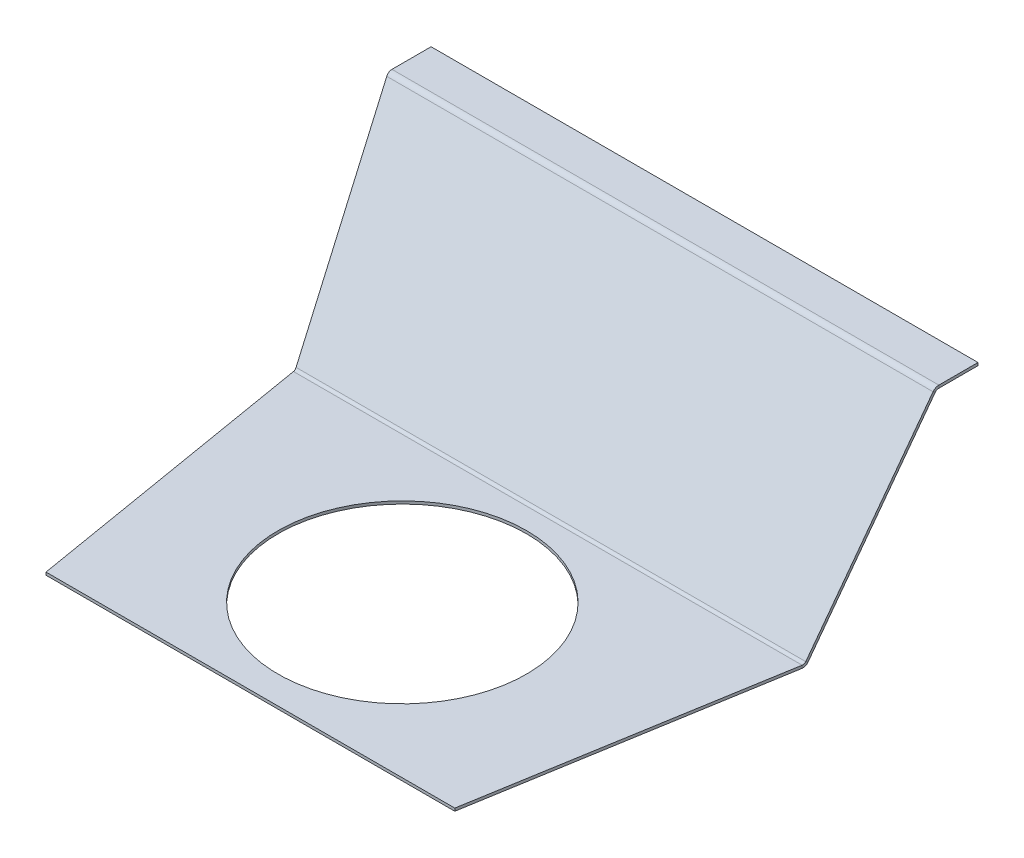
ISO-10303-21;
HEADER;
FILE_DESCRIPTION(('STEP AP214'),'2;1');
FILE_NAME('part.step','',(''),(''),'','','');
FILE_SCHEMA(('AUTOMOTIVE_DESIGN { 1 0 10303 214 1 1 1 1 }'));
ENDSEC;
DATA;
#1=APPLICATION_CONTEXT('core data for automotive mechanical design processes');
#2=APPLICATION_PROTOCOL_DEFINITION('international standard','automotive_design',2000,#1);
#3=PRODUCT_CONTEXT('',#1,'mechanical');
#4=PRODUCT('Part','Part','',(#3));
#5=PRODUCT_RELATED_PRODUCT_CATEGORY('part','',(#4));
#6=PRODUCT_DEFINITION_FORMATION('','',#4);
#7=PRODUCT_DEFINITION_CONTEXT('part definition',#1,'design');
#8=PRODUCT_DEFINITION('design','',#6,#7);
#9=PRODUCT_DEFINITION_SHAPE('','',#8);
#10=(LENGTH_UNIT() NAMED_UNIT(*) SI_UNIT(.MILLI.,.METRE.));
#11=(NAMED_UNIT(*) PLANE_ANGLE_UNIT() SI_UNIT($,.RADIAN.));
#12=(NAMED_UNIT(*) SI_UNIT($,.STERADIAN.) SOLID_ANGLE_UNIT());
#13=UNCERTAINTY_MEASURE_WITH_UNIT(LENGTH_MEASURE(1.E-05),#10,'distance_accuracy_value','');
#14=(GEOMETRIC_REPRESENTATION_CONTEXT(3) GLOBAL_UNCERTAINTY_ASSIGNED_CONTEXT((#13)) GLOBAL_UNIT_ASSIGNED_CONTEXT((#10,
#11,#12)) REPRESENTATION_CONTEXT('',''));
#15=CARTESIAN_POINT('',(0.,0.,0.));
#16=DIRECTION('',(0.,0.,1.));
#17=DIRECTION('',(1.,0.,0.));
#18=AXIS2_PLACEMENT_3D('',#15,#16,#17);
#19=CARTESIAN_POINT('',(184.498123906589,2.9856413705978,-217.416783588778));
#20=DIRECTION('',(0.996484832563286,-0.0725114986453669,0.0419530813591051));
#21=DIRECTION('',(-0.0837733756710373,-0.862524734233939,0.499032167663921));
#22=AXIS2_PLACEMENT_3D('',#19,#20,#21);
#23=PLANE('',#22);
#24=DIRECTION('',(0.,0.50079253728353,0.865567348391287));
#25=VECTOR('',#24,1.);
#26=CARTESIAN_POINT('',(184.528470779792,3.29809062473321,-217.597557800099));
#27=LINE('',#26,#25);
#28=CARTESIAN_POINT('',(184.528470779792,2.29650555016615,-219.328692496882));
#29=VERTEX_POINT('',#28);
#30=CARTESIAN_POINT('',(184.528470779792,3.29809062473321,-217.597557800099));
#31=VERTEX_POINT('',#30);
#32=EDGE_CURVE('E11',#29,#31,#27,.T.);
#33=ORIENTED_EDGE('',*,*,#32,.F.);
#34=DIRECTION('',(-0.0837733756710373,-0.862524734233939,0.499032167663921));
#35=VECTOR('',#34,1.);
#36=CARTESIAN_POINT('',(184.498123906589,1.98405629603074,-219.147918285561));
#37=LINE('',#36,#35);
#38=CARTESIAN_POINT('',(197.777255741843,138.705055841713,-298.25078230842));
#39=VERTEX_POINT('',#38);
#40=EDGE_CURVE('E99',#39,#29,#37,.T.);
#41=ORIENTED_EDGE('',*,*,#40,.F.);
#42=DIRECTION('',(0.,0.50079253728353,0.865567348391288));
#43=VECTOR('',#42,1.);
#44=CARTESIAN_POINT('',(197.777255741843,139.706640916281,-296.519647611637));
#45=LINE('',#44,#43);
#46=CARTESIAN_POINT('',(197.777255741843,139.706640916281,-296.519647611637));
#47=VERTEX_POINT('',#46);
#48=EDGE_CURVE('E47',#39,#47,#45,.T.);
#49=ORIENTED_EDGE('',*,*,#48,.T.);
#50=DIRECTION('',(-0.0837733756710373,-0.862524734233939,0.499032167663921));
#51=VECTOR('',#50,1.);
#52=CARTESIAN_POINT('',(184.498123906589,2.9856413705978,-217.416783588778));
#53=LINE('',#52,#51);
#54=EDGE_CURVE('E102',#47,#31,#53,.T.);
#55=ORIENTED_EDGE('',*,*,#54,.T.);
#56=EDGE_LOOP('',(#33,#41,#49,#55));
#57=FACE_BOUND('',#56,.T.);
#58=ADVANCED_FACE('F37',(#57),#23,.T.);
#59=CARTESIAN_POINT('',(197.107608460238,132.812,-300.496064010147));
#60=CARTESIAN_POINT('',(197.107608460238,133.478666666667,-300.496064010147));
#61=CARTESIAN_POINT('',(197.107608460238,134.145333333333,-300.496064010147));
#62=CARTESIAN_POINT('',(197.107608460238,134.812,-300.496064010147));
#63=CARTESIAN_POINT('',(197.107608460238,132.812,-291.308064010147));
#64=CARTESIAN_POINT('',(197.107608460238,133.478666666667,-292.64139734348));
#65=CARTESIAN_POINT('',(197.107608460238,134.145333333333,-293.974730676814));
#66=CARTESIAN_POINT('',(197.107608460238,134.812,-295.308064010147));
#67=CARTESIAN_POINT('',(198.,142.,-291.308064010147));
#68=CARTESIAN_POINT('',(198.,141.333333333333,-292.64139734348));
#69=CARTESIAN_POINT('',(198.,140.666666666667,-293.974730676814));
#70=CARTESIAN_POINT('',(198.,140.,-295.308064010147));
#71=CARTESIAN_POINT('',(198.,142.,-300.496064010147));
#72=CARTESIAN_POINT('',(198.,141.333333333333,-300.496064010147));
#73=CARTESIAN_POINT('',(198.,140.666666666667,-300.496064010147));
#74=CARTESIAN_POINT('',(198.,140.,-300.496064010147));
#75=CARTESIAN_POINT('',(198.,142.,-309.684064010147));
#76=CARTESIAN_POINT('',(198.,141.333333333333,-308.350730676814));
#77=CARTESIAN_POINT('',(198.,140.666666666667,-307.01739734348));
#78=CARTESIAN_POINT('',(198.,140.,-305.684064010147));
#79=CARTESIAN_POINT('',(197.107608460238,132.812,-309.684064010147));
#80=CARTESIAN_POINT('',(197.107608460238,133.478666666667,-308.350730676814));
#81=CARTESIAN_POINT('',(197.107608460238,134.145333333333,-307.01739734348));
#82=CARTESIAN_POINT('',(197.107608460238,134.812,-305.684064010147));
#83=CARTESIAN_POINT('',(197.107608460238,132.812,-300.496064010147));
#84=CARTESIAN_POINT('',(197.107608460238,133.478666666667,-300.496064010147));
#85=CARTESIAN_POINT('',(197.107608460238,134.145333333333,-300.496064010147));
#86=CARTESIAN_POINT('',(197.107608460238,134.812,-300.496064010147));
#87=(BOUNDED_SURFACE() B_SPLINE_SURFACE(3,3,((#59,#60,#61,#62),(#63,#64,#65,#66),(#67,#68,#69,
#70),(#71,#72,#73,#74),(#75,#76,#77,#78),(#79,#80,#81,#82),(#83,#84,#85,#86)),.UNSPECIFIED.,.T.,
.F.,.F.) B_SPLINE_SURFACE_WITH_KNOTS((4,3,4),(4,4),(0.,0.5,1.),(0.,1.),
.UNSPECIFIED.) GEOMETRIC_REPRESENTATION_ITEM() RATIONAL_B_SPLINE_SURFACE(((1.,1.,1.,1.),
(0.333333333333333,0.333333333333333,0.333333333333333,0.333333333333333),(0.333333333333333,
0.333333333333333,0.333333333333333,0.333333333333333),(1.,1.,1.,1.),(0.333333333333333,
0.333333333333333,0.333333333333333,0.333333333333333),(0.333333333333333,0.333333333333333,
0.333333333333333,0.333333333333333),(1.,1.,1.,1.))) REPRESENTATION_ITEM('') SURFACE());
#88=CARTESIAN_POINT('',(197.553804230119,137.406,-300.496064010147));
#89=DIRECTION('',(0.985526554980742,-0.169521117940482,0.));
#90=DIRECTION('',(-0.169521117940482,-0.985526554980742,0.));
#91=AXIS2_PLACEMENT_3D('',#88,#89,#90);
#92=ELLIPSE('',#91,2.63209548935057,2.594);
#93=CARTESIAN_POINT('',(198.,140.,-300.496064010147));
#94=VERTEX_POINT('',#93);
#95=EDGE_CURVE('E136',#39,#94,#92,.F.);
#96=DIRECTION('',(0.,1.,0.));
#97=VECTOR('',#96,1.);
#98=CARTESIAN_POINT('',(198.,142.,-300.496064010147));
#99=LINE('',#98,#97);
#100=CARTESIAN_POINT('',(198.,142.,-300.496064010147));
#101=VERTEX_POINT('',#100);
#102=EDGE_CURVE('E55',#94,#101,#99,.T.);
#103=CARTESIAN_POINT('',(197.553804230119,137.406,-300.496064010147));
#104=DIRECTION('',(0.995316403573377,-0.0966708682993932,0.));
#105=DIRECTION('',(-0.0966708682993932,-0.995316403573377,0.));
#106=AXIS2_PLACEMENT_3D('',#103,#104,#105);
#107=ELLIPSE('',#106,4.61561769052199,4.594);
#108=EDGE_CURVE('E180',#47,#101,#107,.F.);
#109=ORIENTED_EDGE('',*,*,#48,.F.);
#110=ORIENTED_EDGE('',*,*,#95,.T.);
#111=ORIENTED_EDGE('',*,*,#102,.T.);
#112=ORIENTED_EDGE('',*,*,#108,.F.);
#113=EDGE_LOOP('',(#109,#110,#111,#112));
#114=FACE_BOUND('',#113,.T.);
#115=ADVANCED_FACE('F181',(#114),#87,.F.);
#116=CARTESIAN_POINT('',(198.,142.,-297.846519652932));
#117=DIRECTION('',(1.,0.,0.));
#118=DIRECTION('',(0.,0.,1.));
#119=AXIS2_PLACEMENT_3D('',#116,#117,#118);
#120=PLANE('',#119);
#121=ORIENTED_EDGE('',*,*,#102,.F.);
#122=DIRECTION('',(0.,0.,-1.));
#123=VECTOR('',#122,1.);
#124=CARTESIAN_POINT('',(198.,140.,-297.846519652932));
#125=LINE('',#124,#123);
#126=CARTESIAN_POINT('',(198.,140.,-328.846519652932));
#127=VERTEX_POINT('',#126);
#128=EDGE_CURVE('E223',#127,#94,#125,.F.);
#129=ORIENTED_EDGE('',*,*,#128,.F.);
#130=DIRECTION('',(0.,1.,0.));
#131=VECTOR('',#130,1.);
#132=CARTESIAN_POINT('',(198.,142.,-328.846519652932));
#133=LINE('',#132,#131);
#134=CARTESIAN_POINT('',(198.,142.,-328.846519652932));
#135=VERTEX_POINT('',#134);
#136=EDGE_CURVE('E164',#127,#135,#133,.T.);
#137=ORIENTED_EDGE('',*,*,#136,.T.);
#138=DIRECTION('',(0.,0.,1.));
#139=VECTOR('',#138,1.);
#140=CARTESIAN_POINT('',(198.,142.,-297.846519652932));
#141=LINE('',#140,#139);
#142=EDGE_CURVE('E239',#135,#101,#141,.T.);
#143=ORIENTED_EDGE('',*,*,#142,.T.);
#144=EDGE_LOOP('',(#121,#129,#137,#143));
#145=FACE_BOUND('',#144,.T.);
#146=ADVANCED_FACE('F237',(#145),#120,.T.);
#147=CARTESIAN_POINT('',(198.,142.,-328.846519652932));
#148=DIRECTION('',(0.,0.,1.));
#149=DIRECTION('',(-1.,0.,0.));
#150=AXIS2_PLACEMENT_3D('',#147,#148,#149);
#151=PLANE('',#150);
#152=ORIENTED_EDGE('',*,*,#136,.F.);
#153=DIRECTION('',(1.,0.,0.));
#154=VECTOR('',#153,1.);
#155=CARTESIAN_POINT('',(198.,140.,-328.846519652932));
#156=LINE('',#155,#154);
#157=CARTESIAN_POINT('',(-198.,140.,-328.846519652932));
#158=VERTEX_POINT('',#157);
#159=EDGE_CURVE('E211',#127,#158,#156,.F.);
#160=ORIENTED_EDGE('',*,*,#159,.T.);
#161=DIRECTION('',(0.,1.,0.));
#162=VECTOR('',#161,1.);
#163=CARTESIAN_POINT('',(-198.,142.,-328.846519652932));
#164=LINE('',#163,#162);
#165=CARTESIAN_POINT('',(-198.,142.,-328.846519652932));
#166=VERTEX_POINT('',#165);
#167=EDGE_CURVE('E161',#158,#166,#164,.T.);
#168=ORIENTED_EDGE('',*,*,#167,.T.);
#169=DIRECTION('',(-1.,0.,0.));
#170=VECTOR('',#169,1.);
#171=CARTESIAN_POINT('',(198.,142.,-328.846519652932));
#172=LINE('',#171,#170);
#173=EDGE_CURVE('E243',#135,#166,#172,.T.);
#174=ORIENTED_EDGE('',*,*,#173,.F.);
#175=EDGE_LOOP('',(#152,#160,#168,#174));
#176=FACE_BOUND('',#175,.T.);
#177=ADVANCED_FACE('F294',(#176),#151,.F.);
#178=CARTESIAN_POINT('',(-198.,142.,-297.846519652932));
#179=DIRECTION('',(1.,0.,0.));
#180=DIRECTION('',(0.,0.,1.));
#181=AXIS2_PLACEMENT_3D('',#178,#179,#180);
#182=PLANE('',#181);
#183=ORIENTED_EDGE('',*,*,#167,.F.);
#184=DIRECTION('',(0.,0.,-1.));
#185=VECTOR('',#184,1.);
#186=CARTESIAN_POINT('',(-198.,140.,-297.846519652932));
#187=LINE('',#186,#185);
#188=CARTESIAN_POINT('',(-198.,140.,-300.496064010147));
#189=VERTEX_POINT('',#188);
#190=EDGE_CURVE('E217',#158,#189,#187,.F.);
#191=ORIENTED_EDGE('',*,*,#190,.T.);
#192=DIRECTION('',(0.,1.,0.));
#193=VECTOR('',#192,1.);
#194=CARTESIAN_POINT('',(-198.,142.,-300.496064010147));
#195=LINE('',#194,#193);
#196=CARTESIAN_POINT('',(-198.,142.,-300.496064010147));
#197=VERTEX_POINT('',#196);
#198=EDGE_CURVE('E159',#189,#197,#195,.T.);
#199=ORIENTED_EDGE('',*,*,#198,.T.);
#200=DIRECTION('',(0.,0.,1.));
#201=VECTOR('',#200,1.);
#202=CARTESIAN_POINT('',(-198.,142.,-297.846519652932));
#203=LINE('',#202,#201);
#204=EDGE_CURVE('E244',#166,#197,#203,.T.);
#205=ORIENTED_EDGE('',*,*,#204,.F.);
#206=EDGE_LOOP('',(#183,#191,#199,#205));
#207=FACE_BOUND('',#206,.T.);
#208=ADVANCED_FACE('F295',(#207),#182,.F.);
#209=CARTESIAN_POINT('',(-198.,140.,-300.496064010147));
#210=CARTESIAN_POINT('',(-198.,140.666666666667,-300.496064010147));
#211=CARTESIAN_POINT('',(-198.,141.333333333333,-300.496064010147));
#212=CARTESIAN_POINT('',(-198.,142.,-300.496064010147));
#213=CARTESIAN_POINT('',(-198.,140.,-295.308064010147));
#214=CARTESIAN_POINT('',(-198.,140.666666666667,-293.974730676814));
#215=CARTESIAN_POINT('',(-198.,141.333333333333,-292.64139734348));
#216=CARTESIAN_POINT('',(-198.,142.,-291.308064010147));
#217=CARTESIAN_POINT('',(-197.107608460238,134.812,-295.308064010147));
#218=CARTESIAN_POINT('',(-197.107608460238,134.145333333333,-293.974730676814));
#219=CARTESIAN_POINT('',(-197.107608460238,133.478666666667,-292.64139734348));
#220=CARTESIAN_POINT('',(-197.107608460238,132.812,-291.308064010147));
#221=CARTESIAN_POINT('',(-197.107608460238,134.812,-300.496064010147));
#222=CARTESIAN_POINT('',(-197.107608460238,134.145333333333,-300.496064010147));
#223=CARTESIAN_POINT('',(-197.107608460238,133.478666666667,-300.496064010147));
#224=CARTESIAN_POINT('',(-197.107608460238,132.812,-300.496064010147));
#225=CARTESIAN_POINT('',(-197.107608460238,134.812,-305.684064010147));
#226=CARTESIAN_POINT('',(-197.107608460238,134.145333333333,-307.01739734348));
#227=CARTESIAN_POINT('',(-197.107608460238,133.478666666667,-308.350730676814));
#228=CARTESIAN_POINT('',(-197.107608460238,132.812,-309.684064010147));
#229=CARTESIAN_POINT('',(-198.,140.,-305.684064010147));
#230=CARTESIAN_POINT('',(-198.,140.666666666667,-307.01739734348));
#231=CARTESIAN_POINT('',(-198.,141.333333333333,-308.350730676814));
#232=CARTESIAN_POINT('',(-198.,142.,-309.684064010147));
#233=CARTESIAN_POINT('',(-198.,140.,-300.496064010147));
#234=CARTESIAN_POINT('',(-198.,140.666666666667,-300.496064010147));
#235=CARTESIAN_POINT('',(-198.,141.333333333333,-300.496064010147));
#236=CARTESIAN_POINT('',(-198.,142.,-300.496064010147));
#237=(BOUNDED_SURFACE() B_SPLINE_SURFACE(3,3,((#209,#210,#211,#212),(#213,#214,#215,#216),(#217,
#218,#219,#220),(#221,#222,#223,#224),(#225,#226,#227,#228),(#229,#230,#231,#232),(#233,#234,
#235,#236)),.UNSPECIFIED.,.T.,.F.,.F.) B_SPLINE_SURFACE_WITH_KNOTS((4,3,4),(4,4),(0.,0.5,1.),
(0.,1.),.UNSPECIFIED.) GEOMETRIC_REPRESENTATION_ITEM() RATIONAL_B_SPLINE_SURFACE(((1.,1.,1.,1.),
(0.333333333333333,0.333333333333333,0.333333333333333,0.333333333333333),(0.333333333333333,
0.333333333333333,0.333333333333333,0.333333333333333),(1.,1.,1.,1.),(0.333333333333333,
0.333333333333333,0.333333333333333,0.333333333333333),(0.333333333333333,0.333333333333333,
0.333333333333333,0.333333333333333),(1.,1.,1.,1.))) REPRESENTATION_ITEM('') SURFACE());
#238=CARTESIAN_POINT('',(-197.553804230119,137.406,-300.496064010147));
#239=DIRECTION('',(0.985526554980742,0.169521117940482,0.));
#240=DIRECTION('',(-0.169521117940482,0.985526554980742,0.));
#241=AXIS2_PLACEMENT_3D('',#238,#239,#240);
#242=ELLIPSE('',#241,2.63209548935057,2.594);
#243=CARTESIAN_POINT('',(-197.777255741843,138.705055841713,-298.25078230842));
#244=VERTEX_POINT('',#243);
#245=EDGE_CURVE('E218',#189,#244,#242,.T.);
#246=DIRECTION('',(0.,0.50079253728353,0.865567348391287));
#247=VECTOR('',#246,1.);
#248=CARTESIAN_POINT('',(-197.777255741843,139.706640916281,-296.519647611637));
#249=LINE('',#248,#247);
#250=CARTESIAN_POINT('',(-197.777255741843,139.706640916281,-296.519647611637));
#251=VERTEX_POINT('',#250);
#252=EDGE_CURVE('E156',#244,#251,#249,.T.);
#253=CARTESIAN_POINT('',(-197.553804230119,137.406,-300.496064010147));
#254=DIRECTION('',(0.995316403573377,0.0966708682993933,0.));
#255=DIRECTION('',(-0.0966708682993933,0.995316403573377,0.));
#256=AXIS2_PLACEMENT_3D('',#253,#254,#255);
#257=ELLIPSE('',#256,4.61561769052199,4.594);
#258=EDGE_CURVE('E186',#197,#251,#257,.T.);
#259=ORIENTED_EDGE('',*,*,#198,.F.);
#260=ORIENTED_EDGE('',*,*,#245,.T.);
#261=ORIENTED_EDGE('',*,*,#252,.T.);
#262=ORIENTED_EDGE('',*,*,#258,.F.);
#263=EDGE_LOOP('',(#259,#260,#261,#262));
#264=FACE_BOUND('',#263,.T.);
#265=ADVANCED_FACE('F253',(#264),#237,.T.);
#266=CARTESIAN_POINT('',(-181.719004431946,-25.6279756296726,-200.861762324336));
#267=DIRECTION('',(-0.996484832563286,-0.072511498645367,0.0419530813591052));
#268=DIRECTION('',(-0.0837733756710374,0.862524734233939,-0.499032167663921));
#269=AXIS2_PLACEMENT_3D('',#266,#267,#268);
#270=PLANE('',#269);
#271=ORIENTED_EDGE('',*,*,#252,.F.);
#272=DIRECTION('',(-0.0837733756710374,0.862524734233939,-0.499032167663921));
#273=VECTOR('',#272,1.);
#274=CARTESIAN_POINT('',(-181.719004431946,-26.6295607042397,-202.592897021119));
#275=LINE('',#274,#273);
#276=CARTESIAN_POINT('',(-184.528470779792,2.29650555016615,-219.328692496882));
#277=VERTEX_POINT('',#276);
#278=EDGE_CURVE('E129',#277,#244,#275,.T.);
#279=ORIENTED_EDGE('',*,*,#278,.F.);
#280=DIRECTION('',(0.,0.500792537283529,0.865567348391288));
#281=VECTOR('',#280,1.);
#282=CARTESIAN_POINT('',(-184.528470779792,3.29809062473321,-217.597557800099));
#283=LINE('',#282,#281);
#284=CARTESIAN_POINT('',(-184.528470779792,3.29809062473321,-217.597557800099));
#285=VERTEX_POINT('',#284);
#286=EDGE_CURVE('E153',#277,#285,#283,.T.);
#287=ORIENTED_EDGE('',*,*,#286,.T.);
#288=DIRECTION('',(-0.0837733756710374,0.862524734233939,-0.499032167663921));
#289=VECTOR('',#288,1.);
#290=CARTESIAN_POINT('',(-181.719004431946,-25.6279756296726,-200.861762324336));
#291=LINE('',#290,#289);
#292=EDGE_CURVE('E177',#285,#251,#291,.T.);
#293=ORIENTED_EDGE('',*,*,#292,.T.);
#294=EDGE_LOOP('',(#271,#279,#287,#293));
#295=FACE_BOUND('',#294,.T.);
#296=ADVANCED_FACE('F257',(#295),#270,.T.);
#297=CARTESIAN_POINT('',(-183.71609235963,4.59714646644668,-210.758276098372));
#298=CARTESIAN_POINT('',(-183.71609235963,4.59714646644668,-211.424942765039));
#299=CARTESIAN_POINT('',(-183.71609235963,4.59714646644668,-212.091609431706));
#300=CARTESIAN_POINT('',(-183.71609235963,4.59714646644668,-212.758276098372));
#301=CARTESIAN_POINT('',(-183.71609235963,13.7851464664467,-210.758276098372));
#302=CARTESIAN_POINT('',(-183.71609235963,12.4518131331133,-211.424942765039));
#303=CARTESIAN_POINT('',(-183.71609235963,11.11847979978,-212.091609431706));
#304=CARTESIAN_POINT('',(-183.71609235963,9.78514646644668,-212.758276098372));
#305=CARTESIAN_POINT('',(-184.587010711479,13.7851464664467,-219.946276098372));
#306=CARTESIAN_POINT('',(-184.587010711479,12.4518131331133,-219.279609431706));
#307=CARTESIAN_POINT('',(-184.587010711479,11.11847979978,-218.612942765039));
#308=CARTESIAN_POINT('',(-184.587010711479,9.78514646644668,-217.946276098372));
#309=CARTESIAN_POINT('',(-184.587010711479,4.59714646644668,-219.946276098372));
#310=CARTESIAN_POINT('',(-184.587010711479,4.59714646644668,-219.279609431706));
#311=CARTESIAN_POINT('',(-184.587010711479,4.59714646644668,-218.612942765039));
#312=CARTESIAN_POINT('',(-184.587010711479,4.59714646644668,-217.946276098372));
#313=CARTESIAN_POINT('',(-184.587010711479,-4.59085353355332,-219.946276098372));
#314=CARTESIAN_POINT('',(-184.587010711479,-3.25752020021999,-219.279609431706));
#315=CARTESIAN_POINT('',(-184.587010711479,-1.92418686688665,-218.612942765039));
#316=CARTESIAN_POINT('',(-184.587010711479,-0.590853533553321,-217.946276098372));
#317=CARTESIAN_POINT('',(-183.71609235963,-4.59085353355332,-210.758276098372));
#318=CARTESIAN_POINT('',(-183.71609235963,-3.25752020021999,-211.424942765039));
#319=CARTESIAN_POINT('',(-183.71609235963,-1.92418686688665,-212.091609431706));
#320=CARTESIAN_POINT('',(-183.71609235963,-0.590853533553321,-212.758276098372));
#321=CARTESIAN_POINT('',(-183.71609235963,4.59714646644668,-210.758276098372));
#322=CARTESIAN_POINT('',(-183.71609235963,4.59714646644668,-211.424942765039));
#323=CARTESIAN_POINT('',(-183.71609235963,4.59714646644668,-212.091609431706));
#324=CARTESIAN_POINT('',(-183.71609235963,4.59714646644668,-212.758276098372));
#325=(BOUNDED_SURFACE() B_SPLINE_SURFACE(3,3,((#297,#298,#299,#300),(#301,#302,#303,#304),(#305,
#306,#307,#308),(#309,#310,#311,#312),(#313,#314,#315,#316),(#317,#318,#319,#320),(#321,#322,
#323,#324)),.UNSPECIFIED.,.T.,.F.,.F.) B_SPLINE_SURFACE_WITH_KNOTS((4,3,4),(4,4),(0.,0.5,1.),
(0.,1.),.UNSPECIFIED.) GEOMETRIC_REPRESENTATION_ITEM() RATIONAL_B_SPLINE_SURFACE(((1.,1.,1.,1.),
(0.333333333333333,0.333333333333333,0.333333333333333,0.333333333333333),(0.333333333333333,
0.333333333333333,0.333333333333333,0.333333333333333),(1.,1.,1.,1.),(0.333333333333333,
0.333333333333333,0.333333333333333,0.333333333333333),(0.333333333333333,0.333333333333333,
0.333333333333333,0.333333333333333),(1.,1.,1.,1.))) REPRESENTATION_ITEM('') SURFACE());
#326=CARTESIAN_POINT('',(-184.151551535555,4.59714646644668,-215.352276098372));
#327=DIRECTION('',(0.995537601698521,0.,-0.0943656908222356));
#328=DIRECTION('',(0.0943656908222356,0.,0.995537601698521));
#329=AXIS2_PLACEMENT_3D('',#326,#327,#328);
#330=ELLIPSE('',#329,4.61459214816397,4.594);
#331=CARTESIAN_POINT('',(-184.151551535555,0.0031464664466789,-215.352276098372));
#332=VERTEX_POINT('',#331);
#333=EDGE_CURVE('E118',#277,#332,#330,.F.);
#334=DIRECTION('',(0.,1.,0.));
#335=VECTOR('',#334,1.);
#336=CARTESIAN_POINT('',(-184.151551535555,2.00314646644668,-215.352276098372));
#337=LINE('',#336,#335);
#338=CARTESIAN_POINT('',(-184.151551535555,2.00314646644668,-215.352276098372));
#339=VERTEX_POINT('',#338);
#340=EDGE_CURVE('E150',#332,#339,#337,.T.);
#341=CARTESIAN_POINT('',(-184.151551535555,4.59714646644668,-215.352276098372));
#342=DIRECTION('',(0.986200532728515,0.,-0.165555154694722));
#343=DIRECTION('',(0.165555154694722,0.,0.986200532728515));
#344=AXIS2_PLACEMENT_3D('',#341,#342,#343);
#345=ELLIPSE('',#344,2.63029669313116,2.594);
#346=EDGE_CURVE('E185',#285,#339,#345,.F.);
#347=ORIENTED_EDGE('',*,*,#286,.F.);
#348=ORIENTED_EDGE('',*,*,#333,.T.);
#349=ORIENTED_EDGE('',*,*,#340,.T.);
#350=ORIENTED_EDGE('',*,*,#346,.F.);
#351=EDGE_LOOP('',(#347,#348,#349,#350));
#352=FACE_BOUND('',#351,.T.);
#353=ADVANCED_FACE('F341',(#352),#325,.T.);
#354=CARTESIAN_POINT('',(-138.516655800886,2.00314646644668,56.4916212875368));
#355=DIRECTION('',(-0.986200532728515,0.,0.165555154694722));
#356=DIRECTION('',(-0.165555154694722,0.,-0.986200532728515));
#357=AXIS2_PLACEMENT_3D('',#354,#355,#356);
#358=PLANE('',#357);
#359=ORIENTED_EDGE('',*,*,#340,.F.);
#360=DIRECTION('',(-0.165555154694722,0.,-0.986200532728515));
#361=VECTOR('',#360,1.);
#362=CARTESIAN_POINT('',(-138.516655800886,0.00314646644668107,56.4916212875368));
#363=LINE('',#362,#361);
#364=CARTESIAN_POINT('',(-148.,0.00314646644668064,0.));
#365=VERTEX_POINT('',#364);
#366=EDGE_CURVE('E210',#365,#332,#363,.T.);
#367=ORIENTED_EDGE('',*,*,#366,.F.);
#368=DIRECTION('',(0.,1.,0.));
#369=VECTOR('',#368,1.);
#370=CARTESIAN_POINT('',(-148.,2.00314646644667,0.));
#371=LINE('',#370,#369);
#372=CARTESIAN_POINT('',(-148.,2.00314646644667,0.));
#373=VERTEX_POINT('',#372);
#374=EDGE_CURVE('E147',#365,#373,#371,.T.);
#375=ORIENTED_EDGE('',*,*,#374,.T.);
#376=DIRECTION('',(-0.165555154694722,0.,-0.986200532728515));
#377=VECTOR('',#376,1.);
#378=CARTESIAN_POINT('',(-138.516655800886,2.00314646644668,56.4916212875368));
#379=LINE('',#378,#377);
#380=EDGE_CURVE('E265',#373,#339,#379,.T.);
#381=ORIENTED_EDGE('',*,*,#380,.T.);
#382=EDGE_LOOP('',(#359,#367,#375,#381));
#383=FACE_BOUND('',#382,.T.);
#384=ADVANCED_FACE('F333',(#383),#358,.T.);
#385=CARTESIAN_POINT('',(198.,2.00314646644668,0.));
#386=DIRECTION('',(0.,0.,1.));
#387=DIRECTION('',(-1.,0.,0.));
#388=AXIS2_PLACEMENT_3D('',#385,#386,#387);
#389=PLANE('',#388);
#390=ORIENTED_EDGE('',*,*,#374,.F.);
#391=DIRECTION('',(1.,0.,0.));
#392=VECTOR('',#391,1.);
#393=CARTESIAN_POINT('',(198.,0.00314646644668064,0.));
#394=LINE('',#393,#392);
#395=CARTESIAN_POINT('',(148.,0.00314646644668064,0.));
#396=VERTEX_POINT('',#395);
#397=EDGE_CURVE('E143',#396,#365,#394,.F.);
#398=ORIENTED_EDGE('',*,*,#397,.F.);
#399=DIRECTION('',(0.,1.,0.));
#400=VECTOR('',#399,1.);
#401=CARTESIAN_POINT('',(148.,2.00314646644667,0.));
#402=LINE('',#401,#400);
#403=CARTESIAN_POINT('',(148.,2.00314646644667,0.));
#404=VERTEX_POINT('',#403);
#405=EDGE_CURVE('E144',#396,#404,#402,.T.);
#406=ORIENTED_EDGE('',*,*,#405,.T.);
#407=DIRECTION('',(-1.,0.,0.));
#408=VECTOR('',#407,1.);
#409=CARTESIAN_POINT('',(198.,2.00314646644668,0.));
#410=LINE('',#409,#408);
#411=EDGE_CURVE('E268',#404,#373,#410,.T.);
#412=ORIENTED_EDGE('',*,*,#411,.T.);
#413=EDGE_LOOP('',(#390,#398,#406,#412));
#414=FACE_BOUND('',#413,.T.);
#415=ADVANCED_FACE('F328',(#414),#389,.T.);
#416=CARTESIAN_POINT('',(149.3704254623,2.00314646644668,-8.16352908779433));
#417=DIRECTION('',(0.986200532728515,0.,0.165555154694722));
#418=DIRECTION('',(-0.165555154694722,0.,0.986200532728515));
#419=AXIS2_PLACEMENT_3D('',#416,#417,#418);
#420=PLANE('',#419);
#421=ORIENTED_EDGE('',*,*,#405,.F.);
#422=DIRECTION('',(-0.165555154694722,0.,0.986200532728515));
#423=VECTOR('',#422,1.);
#424=CARTESIAN_POINT('',(149.3704254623,0.00314646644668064,-8.16352908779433));
#425=LINE('',#424,#423);
#426=CARTESIAN_POINT('',(184.151551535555,0.00314646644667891,-215.352276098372));
#427=VERTEX_POINT('',#426);
#428=EDGE_CURVE('E207',#427,#396,#425,.T.);
#429=ORIENTED_EDGE('',*,*,#428,.F.);
#430=DIRECTION('',(0.,1.,0.));
#431=VECTOR('',#430,1.);
#432=CARTESIAN_POINT('',(184.151551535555,2.00314646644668,-215.352276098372));
#433=LINE('',#432,#431);
#434=CARTESIAN_POINT('',(184.151551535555,2.00314646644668,-215.352276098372));
#435=VERTEX_POINT('',#434);
#436=EDGE_CURVE('E41',#427,#435,#433,.T.);
#437=ORIENTED_EDGE('',*,*,#436,.T.);
#438=DIRECTION('',(-0.165555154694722,0.,0.986200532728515));
#439=VECTOR('',#438,1.);
#440=CARTESIAN_POINT('',(149.3704254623,2.00314646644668,-8.16352908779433));
#441=LINE('',#440,#439);
#442=EDGE_CURVE('E262',#435,#404,#441,.T.);
#443=ORIENTED_EDGE('',*,*,#442,.T.);
#444=EDGE_LOOP('',(#421,#429,#437,#443));
#445=FACE_BOUND('',#444,.T.);
#446=ADVANCED_FACE('F316',(#445),#420,.T.);
#447=CARTESIAN_POINT('',(184.587010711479,4.59714646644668,-219.946276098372));
#448=CARTESIAN_POINT('',(184.587010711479,4.59714646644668,-219.279609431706));
#449=CARTESIAN_POINT('',(184.587010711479,4.59714646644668,-218.612942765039));
#450=CARTESIAN_POINT('',(184.587010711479,4.59714646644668,-217.946276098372));
#451=CARTESIAN_POINT('',(184.587010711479,13.7851464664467,-219.946276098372));
#452=CARTESIAN_POINT('',(184.587010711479,12.4518131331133,-219.279609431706));
#453=CARTESIAN_POINT('',(184.587010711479,11.11847979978,-218.612942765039));
#454=CARTESIAN_POINT('',(184.587010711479,9.78514646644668,-217.946276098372));
#455=CARTESIAN_POINT('',(183.71609235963,13.7851464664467,-210.758276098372));
#456=CARTESIAN_POINT('',(183.716092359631,12.4518131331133,-211.424942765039));
#457=CARTESIAN_POINT('',(183.716092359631,11.11847979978,-212.091609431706));
#458=CARTESIAN_POINT('',(183.71609235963,9.78514646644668,-212.758276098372));
#459=CARTESIAN_POINT('',(183.71609235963,4.59714646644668,-210.758276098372));
#460=CARTESIAN_POINT('',(183.71609235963,4.59714646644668,-211.424942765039));
#461=CARTESIAN_POINT('',(183.71609235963,4.59714646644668,-212.091609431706));
#462=CARTESIAN_POINT('',(183.71609235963,4.59714646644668,-212.758276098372));
#463=CARTESIAN_POINT('',(183.71609235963,-4.59085353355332,-210.758276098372));
#464=CARTESIAN_POINT('',(183.716092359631,-3.25752020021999,-211.424942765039));
#465=CARTESIAN_POINT('',(183.716092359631,-1.92418686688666,-212.091609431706));
#466=CARTESIAN_POINT('',(183.71609235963,-0.590853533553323,-212.758276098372));
#467=CARTESIAN_POINT('',(184.587010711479,-4.59085353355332,-219.946276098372));
#468=CARTESIAN_POINT('',(184.587010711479,-3.25752020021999,-219.279609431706));
#469=CARTESIAN_POINT('',(184.587010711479,-1.92418686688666,-218.612942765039));
#470=CARTESIAN_POINT('',(184.587010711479,-0.590853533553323,-217.946276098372));
#471=CARTESIAN_POINT('',(184.587010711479,4.59714646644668,-219.946276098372));
#472=CARTESIAN_POINT('',(184.587010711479,4.59714646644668,-219.279609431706));
#473=CARTESIAN_POINT('',(184.587010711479,4.59714646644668,-218.612942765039));
#474=CARTESIAN_POINT('',(184.587010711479,4.59714646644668,-217.946276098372));
#475=(BOUNDED_SURFACE() B_SPLINE_SURFACE(3,3,((#447,#448,#449,#450),(#451,#452,#453,#454),(#455,
#456,#457,#458),(#459,#460,#461,#462),(#463,#464,#465,#466),(#467,#468,#469,#470),(#471,#472,
#473,#474)),.UNSPECIFIED.,.T.,.F.,.F.) B_SPLINE_SURFACE_WITH_KNOTS((4,3,4),(4,4),(0.,0.5,1.),
(0.,1.),.UNSPECIFIED.) GEOMETRIC_REPRESENTATION_ITEM() RATIONAL_B_SPLINE_SURFACE(((1.,1.,1.,1.),
(0.333333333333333,0.333333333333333,0.333333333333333,0.333333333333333),(0.333333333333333,
0.333333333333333,0.333333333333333,0.333333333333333),(1.,1.,1.,1.),(0.333333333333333,
0.333333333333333,0.333333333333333,0.333333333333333),(0.333333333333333,0.333333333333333,
0.333333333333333,0.333333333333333),(1.,1.,1.,1.))) REPRESENTATION_ITEM('') SURFACE());
#476=CARTESIAN_POINT('',(184.151551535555,4.59714646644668,-215.352276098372));
#477=DIRECTION('',(-0.995537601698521,0.,-0.0943656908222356));
#478=DIRECTION('',(0.0943656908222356,0.,-0.995537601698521));
#479=AXIS2_PLACEMENT_3D('',#476,#477,#478);
#480=ELLIPSE('',#479,4.61459214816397,4.594);
#481=EDGE_CURVE('E115',#427,#29,#480,.F.);
#482=CARTESIAN_POINT('',(184.151551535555,4.59714646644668,-215.352276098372));
#483=DIRECTION('',(-0.986200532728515,0.,-0.165555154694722));
#484=DIRECTION('',(0.165555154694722,0.,-0.986200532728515));
#485=AXIS2_PLACEMENT_3D('',#482,#483,#484);
#486=ELLIPSE('',#485,2.63029669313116,2.594);
#487=EDGE_CURVE('E178',#435,#31,#486,.F.);
#488=ORIENTED_EDGE('',*,*,#481,.T.);
#489=ORIENTED_EDGE('',*,*,#32,.T.);
#490=ORIENTED_EDGE('',*,*,#487,.F.);
#491=ORIENTED_EDGE('',*,*,#436,.F.);
#492=EDGE_LOOP('',(#488,#489,#490,#491));
#493=FACE_BOUND('',#492,.T.);
#494=ADVANCED_FACE('F132',(#493),#475,.T.);
#495=CARTESIAN_POINT('',(0.,2.00314646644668,-110.));
#496=DIRECTION('',(0.,-1.,0.));
#497=DIRECTION('',(0.,0.,-1.));
#498=AXIS2_PLACEMENT_3D('',#495,#496,#497);
#499=CYLINDRICAL_SURFACE('',#498,90.);
#500=CARTESIAN_POINT('',(0.,2.00314646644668,-110.));
#501=DIRECTION('',(0.,-1.,0.));
#502=DIRECTION('',(0.,0.,-1.));
#503=AXIS2_PLACEMENT_3D('',#500,#501,#502);
#504=CIRCLE('',#503,90.);
#505=CARTESIAN_POINT('',(0.,2.00314646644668,-200.));
#506=VERTEX_POINT('',#505);
#507=EDGE_CURVE('E271',#506,#506,#504,.F.);
#508=ORIENTED_EDGE('',*,*,#507,.T.);
#509=EDGE_LOOP('',(#508));
#510=FACE_BOUND('',#509,.T.);
#511=CARTESIAN_POINT('',(0.,0.00314646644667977,-110.));
#512=DIRECTION('',(0.,-1.,0.));
#513=DIRECTION('',(0.,0.,-1.));
#514=AXIS2_PLACEMENT_3D('',#511,#512,#513);
#515=CIRCLE('',#514,90.);
#516=CARTESIAN_POINT('',(0.,0.00314646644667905,-200.));
#517=VERTEX_POINT('',#516);
#518=EDGE_CURVE('E140',#517,#517,#515,.F.);
#519=ORIENTED_EDGE('',*,*,#518,.F.);
#520=EDGE_LOOP('',(#519));
#521=FACE_BOUND('',#520,.T.);
#522=ADVANCED_FACE('F39',(#510,#521),#499,.F.);
#523=CARTESIAN_POINT('',(198.,2.00314646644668,0.));
#524=DIRECTION('',(0.,-1.,0.));
#525=DIRECTION('',(0.,0.,-1.));
#526=AXIS2_PLACEMENT_3D('',#523,#524,#525);
#527=PLANE('',#526);
#528=ORIENTED_EDGE('',*,*,#442,.F.);
#529=DIRECTION('',(-1.,0.,0.));
#530=VECTOR('',#529,1.);
#531=CARTESIAN_POINT('',(-184.402698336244,2.00314646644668,-215.352276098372));
#532=LINE('',#531,#530);
#533=EDGE_CURVE('E196',#435,#339,#532,.T.);
#534=ORIENTED_EDGE('',*,*,#533,.T.);
#535=ORIENTED_EDGE('',*,*,#380,.F.);
#536=ORIENTED_EDGE('',*,*,#411,.F.);
#537=EDGE_LOOP('',(#528,#534,#535,#536));
#538=FACE_BOUND('',#537,.T.);
#539=ORIENTED_EDGE('',*,*,#507,.F.);
#540=EDGE_LOOP('',(#539));
#541=FACE_BOUND('',#540,.T.);
#542=ADVANCED_FACE('F326',(#538,#541),#527,.F.);
#543=CARTESIAN_POINT('',(198.,142.,-297.846519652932));
#544=DIRECTION('',(0.,-1.,0.));
#545=DIRECTION('',(0.,0.,-1.));
#546=AXIS2_PLACEMENT_3D('',#543,#544,#545);
#547=PLANE('',#546);
#548=ORIENTED_EDGE('',*,*,#204,.T.);
#549=DIRECTION('',(-1.,0.,0.));
#550=VECTOR('',#549,1.);
#551=CARTESIAN_POINT('',(198.,142.,-300.496064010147));
#552=LINE('',#551,#550);
#553=EDGE_CURVE('E192',#197,#101,#552,.F.);
#554=ORIENTED_EDGE('',*,*,#553,.T.);
#555=ORIENTED_EDGE('',*,*,#142,.F.);
#556=ORIENTED_EDGE('',*,*,#173,.T.);
#557=EDGE_LOOP('',(#548,#554,#555,#556));
#558=FACE_BOUND('',#557,.T.);
#559=ADVANCED_FACE('F247',(#558),#547,.F.);
#560=CARTESIAN_POINT('',(198.,2.00314646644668,-216.848340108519));
#561=DIRECTION('',(0.,-0.50079253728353,-0.865567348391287));
#562=DIRECTION('',(0.,0.865567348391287,-0.50079253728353));
#563=AXIS2_PLACEMENT_3D('',#560,#561,#562);
#564=PLANE('',#563);
#565=ORIENTED_EDGE('',*,*,#54,.F.);
#566=DIRECTION('',(-1.,0.,0.));
#567=VECTOR('',#566,1.);
#568=CARTESIAN_POINT('',(198.,139.706640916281,-296.519647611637));
#569=LINE('',#568,#567);
#570=EDGE_CURVE('E174',#47,#251,#569,.T.);
#571=ORIENTED_EDGE('',*,*,#570,.T.);
#572=ORIENTED_EDGE('',*,*,#292,.F.);
#573=DIRECTION('',(-1.,0.,0.));
#574=VECTOR('',#573,1.);
#575=CARTESIAN_POINT('',(184.402698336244,3.29809062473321,-217.597557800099));
#576=LINE('',#575,#574);
#577=EDGE_CURVE('E176',#285,#31,#576,.F.);
#578=ORIENTED_EDGE('',*,*,#577,.T.);
#579=EDGE_LOOP('',(#565,#571,#572,#578));
#580=FACE_BOUND('',#579,.T.);
#581=ADVANCED_FACE('F171',(#580),#564,.F.);
#582=CARTESIAN_POINT('',(198.,4.59714646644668,-215.352276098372));
#583=DIRECTION('',(1.,0.,0.));
#584=DIRECTION('',(0.,0.,-1.));
#585=AXIS2_PLACEMENT_3D('',#582,#583,#584);
#586=CYLINDRICAL_SURFACE('',#585,2.594);
#587=ORIENTED_EDGE('',*,*,#487,.T.);
#588=ORIENTED_EDGE('',*,*,#577,.F.);
#589=ORIENTED_EDGE('',*,*,#346,.T.);
#590=ORIENTED_EDGE('',*,*,#533,.F.);
#591=EDGE_LOOP('',(#587,#588,#589,#590));
#592=FACE_BOUND('',#591,.T.);
#593=ADVANCED_FACE('F279',(#592),#586,.F.);
#594=CARTESIAN_POINT('',(198.,137.406,-300.496064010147));
#595=DIRECTION('',(-1.,0.,0.));
#596=DIRECTION('',(0.,0.,1.));
#597=AXIS2_PLACEMENT_3D('',#594,#595,#596);
#598=CYLINDRICAL_SURFACE('',#597,4.594);
#599=ORIENTED_EDGE('',*,*,#108,.T.);
#600=ORIENTED_EDGE('',*,*,#553,.F.);
#601=ORIENTED_EDGE('',*,*,#258,.T.);
#602=ORIENTED_EDGE('',*,*,#570,.F.);
#603=EDGE_LOOP('',(#599,#600,#601,#602));
#604=FACE_BOUND('',#603,.T.);
#605=ADVANCED_FACE('F189',(#604),#598,.T.);
#606=CARTESIAN_POINT('',(198.,0.00314646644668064,0.));
#607=DIRECTION('',(0.,-1.,0.));
#608=DIRECTION('',(0.,0.,-1.));
#609=AXIS2_PLACEMENT_3D('',#606,#607,#608);
#610=PLANE('',#609);
#611=ORIENTED_EDGE('',*,*,#428,.T.);
#612=ORIENTED_EDGE('',*,*,#397,.T.);
#613=ORIENTED_EDGE('',*,*,#366,.T.);
#614=DIRECTION('',(1.,0.,0.));
#615=VECTOR('',#614,1.);
#616=CARTESIAN_POINT('',(198.,0.00314646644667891,-215.352276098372));
#617=LINE('',#616,#615);
#618=EDGE_CURVE('E123',#427,#332,#617,.F.);
#619=ORIENTED_EDGE('',*,*,#618,.F.);
#620=EDGE_LOOP('',(#611,#612,#613,#619));
#621=FACE_BOUND('',#620,.T.);
#622=ORIENTED_EDGE('',*,*,#518,.T.);
#623=EDGE_LOOP('',(#622));
#624=FACE_BOUND('',#623,.T.);
#625=ADVANCED_FACE('F441',(#621,#624),#610,.T.);
#626=CARTESIAN_POINT('',(198.,140.,-297.846519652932));
#627=DIRECTION('',(0.,-1.,0.));
#628=DIRECTION('',(0.,0.,-1.));
#629=AXIS2_PLACEMENT_3D('',#626,#627,#628);
#630=PLANE('',#629);
#631=ORIENTED_EDGE('',*,*,#190,.F.);
#632=ORIENTED_EDGE('',*,*,#159,.F.);
#633=ORIENTED_EDGE('',*,*,#128,.T.);
#634=DIRECTION('',(1.,0.,0.));
#635=VECTOR('',#634,1.);
#636=CARTESIAN_POINT('',(198.,140.,-300.496064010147));
#637=LINE('',#636,#635);
#638=EDGE_CURVE('E201',#189,#94,#637,.T.);
#639=ORIENTED_EDGE('',*,*,#638,.F.);
#640=EDGE_LOOP('',(#631,#632,#633,#639));
#641=FACE_BOUND('',#640,.T.);
#642=ADVANCED_FACE('F235',(#641),#630,.T.);
#643=CARTESIAN_POINT('',(198.,1.00156139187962,-218.579474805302));
#644=DIRECTION('',(0.,-0.50079253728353,-0.865567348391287));
#645=DIRECTION('',(0.,0.865567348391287,-0.50079253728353));
#646=AXIS2_PLACEMENT_3D('',#643,#644,#645);
#647=PLANE('',#646);
#648=ORIENTED_EDGE('',*,*,#40,.T.);
#649=DIRECTION('',(1.,0.,0.));
#650=VECTOR('',#649,1.);
#651=CARTESIAN_POINT('',(198.,2.29650555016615,-219.328692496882));
#652=LINE('',#651,#650);
#653=EDGE_CURVE('E112',#277,#29,#652,.T.);
#654=ORIENTED_EDGE('',*,*,#653,.F.);
#655=ORIENTED_EDGE('',*,*,#278,.T.);
#656=DIRECTION('',(1.,0.,0.));
#657=VECTOR('',#656,1.);
#658=CARTESIAN_POINT('',(198.,138.705055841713,-298.25078230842));
#659=LINE('',#658,#657);
#660=EDGE_CURVE('E122',#39,#244,#659,.F.);
#661=ORIENTED_EDGE('',*,*,#660,.F.);
#662=EDGE_LOOP('',(#648,#654,#655,#661));
#663=FACE_BOUND('',#662,.T.);
#664=ADVANCED_FACE('F126',(#663),#647,.T.);
#665=CARTESIAN_POINT('',(198.,4.59714646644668,-215.352276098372));
#666=DIRECTION('',(1.,0.,0.));
#667=DIRECTION('',(0.,0.,-1.));
#668=AXIS2_PLACEMENT_3D('',#665,#666,#667);
#669=CYLINDRICAL_SURFACE('',#668,4.594);
#670=ORIENTED_EDGE('',*,*,#481,.F.);
#671=ORIENTED_EDGE('',*,*,#618,.T.);
#672=ORIENTED_EDGE('',*,*,#333,.F.);
#673=ORIENTED_EDGE('',*,*,#653,.T.);
#674=EDGE_LOOP('',(#670,#671,#672,#673));
#675=FACE_BOUND('',#674,.T.);
#676=ADVANCED_FACE('F113',(#675),#669,.T.);
#677=CARTESIAN_POINT('',(198.,137.406,-300.496064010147));
#678=DIRECTION('',(-1.,0.,0.));
#679=DIRECTION('',(0.,0.,1.));
#680=AXIS2_PLACEMENT_3D('',#677,#678,#679);
#681=CYLINDRICAL_SURFACE('',#680,2.594);
#682=ORIENTED_EDGE('',*,*,#95,.F.);
#683=ORIENTED_EDGE('',*,*,#660,.T.);
#684=ORIENTED_EDGE('',*,*,#245,.F.);
#685=ORIENTED_EDGE('',*,*,#638,.T.);
#686=EDGE_LOOP('',(#682,#683,#684,#685));
#687=FACE_BOUND('',#686,.T.);
#688=ADVANCED_FACE('F228',(#687),#681,.F.);
#689=CLOSED_SHELL('',(#58,#115,#146,#177,#208,#265,#296,#353,#384,#415,#446,#494,#522,#542,#559,
#581,#593,#605,#625,#642,#664,#676,#688));
#690=MANIFOLD_SOLID_BREP('B2',#689);
#691=ADVANCED_BREP_SHAPE_REPRESENTATION('',(#18,#690),#14);
#692=SHAPE_DEFINITION_REPRESENTATION(#9,#691);
ENDSEC;
END-ISO-10303-21;
